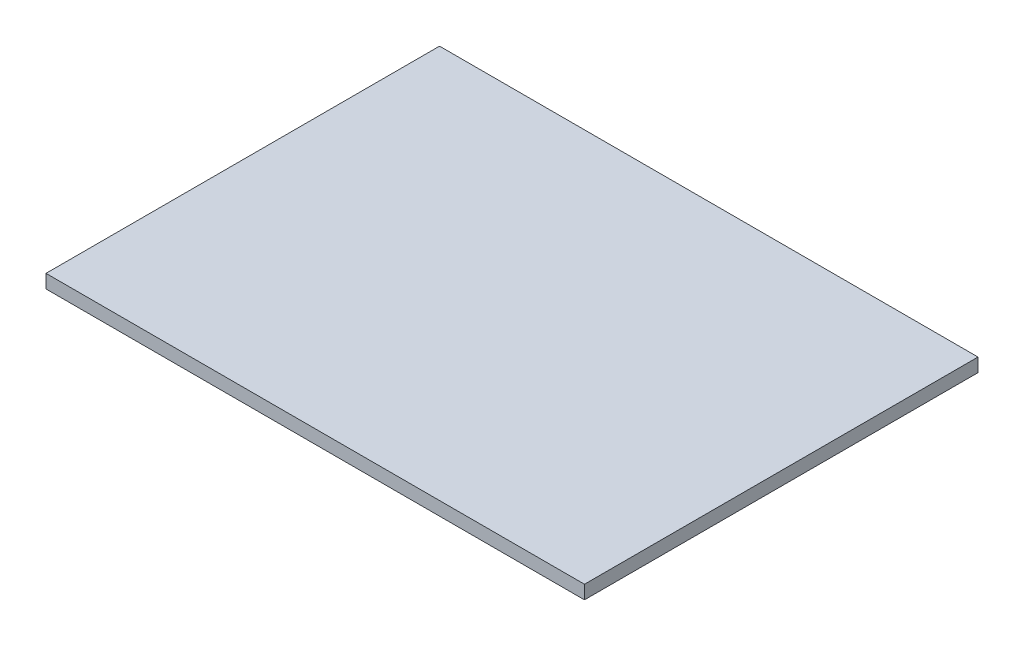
from build123d import *

# Parameters (mm, degrees)
SKETCH_1_W      = 79.5
SKETCH_1_H      = 58.1
EXTRUDE_1_DEPTH = 2


with BuildPart() as part:
    # Sketch 1 → Extrude 1 (new body)
    with BuildSketch(Plane(origin=(0, 0, 0), x_dir=(1, 0, 0), z_dir=(0, 1, 0))):
        Rectangle(SKETCH_1_W, SKETCH_1_H)
    extrude(amount=EXTRUDE_1_DEPTH)


solid = part.part
